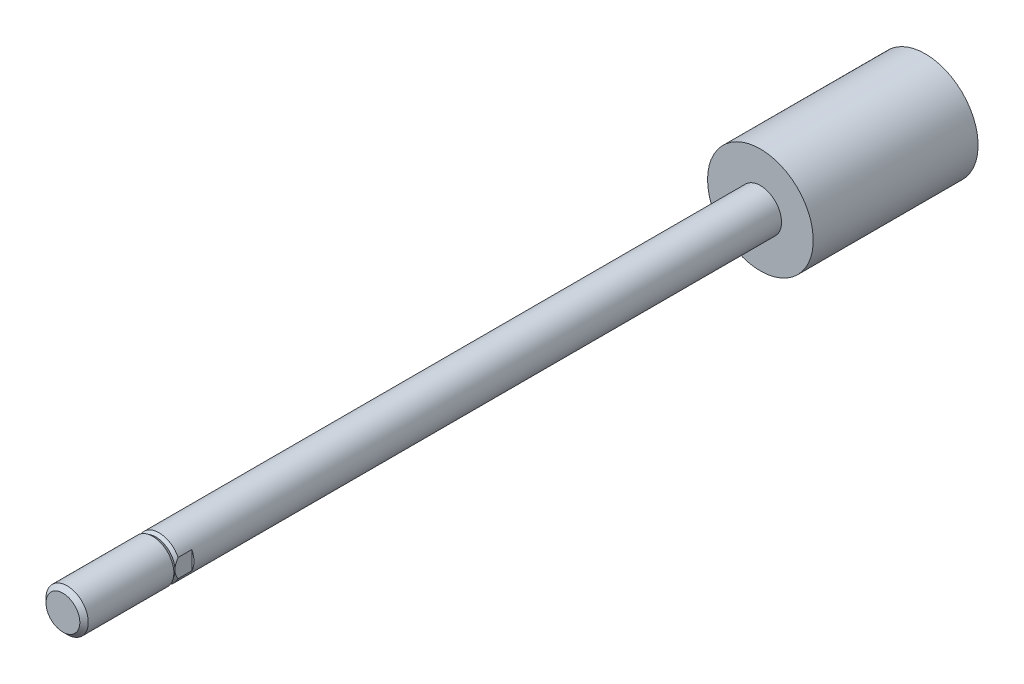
ISO-10303-21;
HEADER;
FILE_DESCRIPTION(('STEP AP214'),'2;1');
FILE_NAME('part.step','',(''),(''),'','','');
FILE_SCHEMA(('AUTOMOTIVE_DESIGN { 1 0 10303 214 1 1 1 1 }'));
ENDSEC;
DATA;
#1=APPLICATION_CONTEXT('core data for automotive mechanical design processes');
#2=APPLICATION_PROTOCOL_DEFINITION('international standard','automotive_design',2000,#1);
#3=PRODUCT_CONTEXT('',#1,'mechanical');
#4=PRODUCT('Part','Part','',(#3));
#5=PRODUCT_RELATED_PRODUCT_CATEGORY('part','',(#4));
#6=PRODUCT_DEFINITION_FORMATION('','',#4);
#7=PRODUCT_DEFINITION_CONTEXT('part definition',#1,'design');
#8=PRODUCT_DEFINITION('design','',#6,#7);
#9=PRODUCT_DEFINITION_SHAPE('','',#8);
#10=(LENGTH_UNIT() NAMED_UNIT(*) SI_UNIT(.MILLI.,.METRE.));
#11=(NAMED_UNIT(*) PLANE_ANGLE_UNIT() SI_UNIT($,.RADIAN.));
#12=(NAMED_UNIT(*) SI_UNIT($,.STERADIAN.) SOLID_ANGLE_UNIT());
#13=UNCERTAINTY_MEASURE_WITH_UNIT(LENGTH_MEASURE(1.E-05),#10,'distance_accuracy_value','');
#14=(GEOMETRIC_REPRESENTATION_CONTEXT(3) GLOBAL_UNCERTAINTY_ASSIGNED_CONTEXT((#13)) GLOBAL_UNIT_ASSIGNED_CONTEXT((#10,
#11,#12)) REPRESENTATION_CONTEXT('',''));
#15=CARTESIAN_POINT('',(0.,0.,0.));
#16=DIRECTION('',(0.,0.,1.));
#17=DIRECTION('',(1.,0.,0.));
#18=AXIS2_PLACEMENT_3D('',#15,#16,#17);
#19=CARTESIAN_POINT('',(12.65,-12.65,0.));
#20=DIRECTION('',(0.,0.,-1.));
#21=DIRECTION('',(-1.,0.,0.));
#22=AXIS2_PLACEMENT_3D('',#19,#20,#21);
#23=PLANE('',#22);
#24=CARTESIAN_POINT('',(0.,0.,0.));
#25=DIRECTION('',(0.,0.,-1.));
#26=DIRECTION('',(-1.,0.,0.));
#27=AXIS2_PLACEMENT_3D('',#24,#25,#26);
#28=CIRCLE('',#27,12.5);
#29=CARTESIAN_POINT('',(-12.5,0.,0.));
#30=VERTEX_POINT('',#29);
#31=EDGE_CURVE('E20',#30,#30,#28,.T.);
#32=ORIENTED_EDGE('',*,*,#31,.T.);
#33=EDGE_LOOP('',(#32));
#34=FACE_BOUND('',#33,.T.);
#35=ADVANCED_FACE('F16',(#34),#23,.T.);
#36=CARTESIAN_POINT('',(0.,0.,39.));
#37=DIRECTION('',(0.,0.,-1.));
#38=DIRECTION('',(-1.,0.,0.));
#39=AXIS2_PLACEMENT_3D('',#36,#37,#38);
#40=CYLINDRICAL_SURFACE('',#39,12.5);
#41=CARTESIAN_POINT('',(0.,0.,39.));
#42=DIRECTION('',(0.,0.,-1.));
#43=DIRECTION('',(-1.,0.,0.));
#44=AXIS2_PLACEMENT_3D('',#41,#42,#43);
#45=CIRCLE('',#44,12.5);
#46=CARTESIAN_POINT('',(-12.5,0.,39.));
#47=VERTEX_POINT('',#46);
#48=EDGE_CURVE('E276',#47,#47,#45,.F.);
#49=ORIENTED_EDGE('',*,*,#48,.F.);
#50=EDGE_LOOP('',(#49));
#51=FACE_BOUND('',#50,.T.);
#52=ORIENTED_EDGE('',*,*,#31,.F.);
#53=EDGE_LOOP('',(#52));
#54=FACE_BOUND('',#53,.T.);
#55=ADVANCED_FACE('F153',(#51,#54),#40,.T.);
#56=CARTESIAN_POINT('',(-5.003,-2.205602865,178.));
#57=DIRECTION('',(0.,0.,1.));
#58=DIRECTION('',(1.,0.,0.));
#59=AXIS2_PLACEMENT_3D('',#56,#57,#58);
#60=PLANE('',#59);
#61=CARTESIAN_POINT('',(0.,0.,178.000000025));
#62=DIRECTION('',(0.,0.,-1.));
#63=DIRECTION('',(0.,1.,0.));
#64=AXIS2_PLACEMENT_3D('',#61,#62,#63);
#65=CIRCLE('',#64,5.);
#66=CARTESIAN_POINT('',(-4.49999999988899,2.17944947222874,178.0000000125));
#67=VERTEX_POINT('',#66);
#68=CARTESIAN_POINT('',(-4.5,-2.17944947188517,178.0000000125));
#69=VERTEX_POINT('',#68);
#70=EDGE_CURVE('E102',#67,#69,#65,.F.);
#71=ORIENTED_EDGE('',*,*,#70,.T.);
#72=DIRECTION('',(0.,1.,0.));
#73=VECTOR('',#72,1.);
#74=CARTESIAN_POINT('',(-4.5,0.,178.));
#75=LINE('',#74,#73);
#76=EDGE_CURVE('E103',#69,#67,#75,.T.);
#77=ORIENTED_EDGE('',*,*,#76,.T.);
#78=EDGE_LOOP('',(#71,#77));
#79=FACE_BOUND('',#78,.T.);
#80=ADVANCED_FACE('F149',(#79),#60,.T.);
#81=CARTESIAN_POINT('',(-12.65,-12.65,39.));
#82=DIRECTION('',(0.,0.,1.));
#83=DIRECTION('',(1.,0.,0.));
#84=AXIS2_PLACEMENT_3D('',#81,#82,#83);
#85=PLANE('',#84);
#86=CARTESIAN_POINT('',(0.,-3.94823063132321E-13,39.));
#87=DIRECTION('',(0.,0.,-1.));
#88=DIRECTION('',(0.,1.,0.));
#89=AXIS2_PLACEMENT_3D('',#86,#87,#88);
#90=CIRCLE('',#89,5.);
#91=CARTESIAN_POINT('',(0.,4.99999999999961,39.));
#92=VERTEX_POINT('',#91);
#93=EDGE_CURVE('E69',#92,#92,#90,.T.);
#94=ORIENTED_EDGE('',*,*,#93,.T.);
#95=EDGE_LOOP('',(#94));
#96=FACE_BOUND('',#95,.T.);
#97=ORIENTED_EDGE('',*,*,#48,.T.);
#98=EDGE_LOOP('',(#97));
#99=FACE_BOUND('',#98,.T.);
#100=ADVANCED_FACE('F146',(#96,#99),#85,.T.);
#101=CARTESIAN_POINT('',(4.5,-2.205602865,178.));
#102=DIRECTION('',(0.,0.,1.));
#103=DIRECTION('',(1.,0.,0.));
#104=AXIS2_PLACEMENT_3D('',#101,#102,#103);
#105=PLANE('',#104);
#106=CARTESIAN_POINT('',(0.,0.,178.000000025));
#107=DIRECTION('',(0.,0.,-1.));
#108=DIRECTION('',(0.,1.,0.));
#109=AXIS2_PLACEMENT_3D('',#106,#107,#108);
#110=CIRCLE('',#109,5.);
#111=CARTESIAN_POINT('',(4.5,-2.17944947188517,178.0000000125));
#112=VERTEX_POINT('',#111);
#113=CARTESIAN_POINT('',(4.5,2.17944947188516,178.0000000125));
#114=VERTEX_POINT('',#113);
#115=EDGE_CURVE('E59',#112,#114,#110,.F.);
#116=ORIENTED_EDGE('',*,*,#115,.T.);
#117=DIRECTION('',(0.,-1.,0.));
#118=VECTOR('',#117,1.);
#119=CARTESIAN_POINT('',(4.5,0.,178.));
#120=LINE('',#119,#118);
#121=EDGE_CURVE('E71',#114,#112,#120,.T.);
#122=ORIENTED_EDGE('',*,*,#121,.T.);
#123=EDGE_LOOP('',(#116,#122));
#124=FACE_BOUND('',#123,.T.);
#125=ADVANCED_FACE('F72',(#124),#105,.T.);
#126=CARTESIAN_POINT('',(-4.5,-2.179449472,182.024));
#127=DIRECTION('',(1.,0.,0.));
#128=DIRECTION('',(0.,0.,-1.));
#129=AXIS2_PLACEMENT_3D('',#126,#127,#128);
#130=PLANE('',#129);
#131=DIRECTION('',(0.,0.,1.));
#132=VECTOR('',#131,1.);
#133=CARTESIAN_POINT('',(-4.49999999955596,2.17944947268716,110.125));
#134=LINE('',#133,#132);
#135=CARTESIAN_POINT('',(-4.49999999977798,2.1794494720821,181.250000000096));
#136=VERTEX_POINT('',#135);
#137=EDGE_CURVE('E100',#136,#67,#134,.F.);
#138=ORIENTED_EDGE('',*,*,#137,.T.);
#139=ORIENTED_EDGE('',*,*,#76,.F.);
#140=DIRECTION('',(0.,0.,-1.));
#141=VECTOR('',#140,1.);
#142=CARTESIAN_POINT('',(-4.5,-2.179449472,180.012));
#143=LINE('',#142,#141);
#144=CARTESIAN_POINT('',(-4.5,-2.17944947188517,181.249999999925));
#145=VERTEX_POINT('',#144);
#146=EDGE_CURVE('E83',#145,#69,#143,.T.);
#147=ORIENTED_EDGE('',*,*,#146,.F.);
#148=CARTESIAN_POINT('',(-4.5,-2.17944947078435,181.250000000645));
#149=CARTESIAN_POINT('',(-4.5,-2.06384936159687,181.325517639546));
#150=CARTESIAN_POINT('',(-4.5,-1.94593594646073,181.397805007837));
#151=CARTESIAN_POINT('',(-4.5,-1.70455072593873,181.533955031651));
#152=CARTESIAN_POINT('',(-4.5,-1.58105289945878,181.597771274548));
#153=CARTESIAN_POINT('',(-4.5,-1.33299920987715,181.712222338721));
#154=CARTESIAN_POINT('',(-4.5,-1.20861697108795,181.763226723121));
#155=CARTESIAN_POINT('',(-4.5,-0.955459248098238,181.851988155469));
#156=CARTESIAN_POINT('',(-4.5,-0.826694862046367,181.889776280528));
#157=CARTESIAN_POINT('',(-4.5,-0.582832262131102,181.945687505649));
#158=CARTESIAN_POINT('',(-4.5,-0.468188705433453,181.965755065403));
#159=CARTESIAN_POINT('',(-4.5,-0.294276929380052,181.986150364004));
#160=CARTESIAN_POINT('',(-4.5,-0.235552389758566,181.991332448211));
#161=CARTESIAN_POINT('',(-4.5,-0.11788968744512,181.998261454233));
#162=CARTESIAN_POINT('',(-4.5,-0.0589514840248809,182.000007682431));
#163=CARTESIAN_POINT('',(-4.5,-2.8851410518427E-10,182.));
#164=B_SPLINE_CURVE_WITH_KNOTS('',3,(#148,#149,#150,#151,#152,#153,#154,#155,#156,#157,#158,
#159,#160,#161,#162,#163),.UNSPECIFIED.,.F.,.F.,(4,2,2,2,2,2,2,4),(0.,0.414444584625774,
0.831073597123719,1.23376409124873,1.63550121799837,1.98391394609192,2.16068182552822,
2.33748538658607),.UNSPECIFIED.);
#165=CARTESIAN_POINT('',(-4.5,-4.32775993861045E-10,182.));
#166=VERTEX_POINT('',#165);
#167=EDGE_CURVE('E90',#145,#166,#164,.T.);
#168=ORIENTED_EDGE('',*,*,#167,.T.);
#169=CARTESIAN_POINT('',(-4.5,-2.88517512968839E-10,182.));
#170=CARTESIAN_POINT('',(-4.5,0.0990392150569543,182.000079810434));
#171=CARTESIAN_POINT('',(-4.5,0.198028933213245,181.995098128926));
#172=CARTESIAN_POINT('',(-4.5,0.394886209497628,181.975637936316));
#173=CARTESIAN_POINT('',(-4.5,0.492755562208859,181.961177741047));
#174=CARTESIAN_POINT('',(-4.5,0.684746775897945,181.923770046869));
#175=CARTESIAN_POINT('',(-4.5,0.778904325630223,181.901002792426));
#176=CARTESIAN_POINT('',(-4.5,0.965068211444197,181.847879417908));
#177=CARTESIAN_POINT('',(-4.5,1.05707375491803,181.817520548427));
#178=CARTESIAN_POINT('',(-4.5,1.23784288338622,181.750503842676));
#179=CARTESIAN_POINT('',(-4.5,1.32662746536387,181.713902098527));
#180=CARTESIAN_POINT('',(-4.5,1.50171378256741,181.635164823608));
#181=CARTESIAN_POINT('',(-4.5,1.588014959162,181.59302805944));
#182=CARTESIAN_POINT('',(-4.5,1.7599990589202,181.503129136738));
#183=CARTESIAN_POINT('',(-4.5,1.84562826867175,181.455265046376));
#184=CARTESIAN_POINT('',(-4.5,2.01436529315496,181.355487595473));
#185=CARTESIAN_POINT('',(-4.5,2.09747595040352,181.3035790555));
#186=CARTESIAN_POINT('',(-4.5,2.17944947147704,181.250000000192));
#187=B_SPLINE_CURVE_WITH_KNOTS('',3,(#169,#170,#171,#172,#173,#174,#175,#176,#177,#178,#179,
#180,#181,#182,#183,#184,#185,#186),.UNSPECIFIED.,.F.,.F.,(4,2,2,2,2,2,2,2,4),(0.,
0.296913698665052,0.593255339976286,0.88351617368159,1.1738822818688,1.46176505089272,
1.74971207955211,2.04388501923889,2.3377125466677),.UNSPECIFIED.);
#188=EDGE_CURVE('E77',#166,#136,#187,.T.);
#189=ORIENTED_EDGE('',*,*,#188,.T.);
#190=EDGE_LOOP('',(#138,#139,#147,#168,#189));
#191=FACE_BOUND('',#190,.T.);
#192=ADVANCED_FACE('F138',(#191),#130,.F.);
#193=CARTESIAN_POINT('',(0.,0.,181.25));
#194=DIRECTION('',(0.,0.,-1.));
#195=DIRECTION('',(0.,1.,0.));
#196=AXIS2_PLACEMENT_3D('',#193,#194,#195);
#197=CYLINDRICAL_SURFACE('',#196,5.);
#198=ORIENTED_EDGE('',*,*,#93,.F.);
#199=EDGE_LOOP('',(#198));
#200=FACE_BOUND('',#199,.T.);
#201=ORIENTED_EDGE('',*,*,#115,.F.);
#202=DIRECTION('',(0.,0.,1.));
#203=VECTOR('',#202,1.);
#204=CARTESIAN_POINT('',(4.5,-2.179449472,180.012));
#205=LINE('',#204,#203);
#206=CARTESIAN_POINT('',(4.5,-2.17944947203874,181.2499999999));
#207=VERTEX_POINT('',#206);
#208=EDGE_CURVE('E64',#112,#207,#205,.T.);
#209=ORIENTED_EDGE('',*,*,#208,.T.);
#210=CARTESIAN_POINT('',(0.,0.,181.25));
#211=DIRECTION('',(0.,0.,-1.));
#212=DIRECTION('',(0.,1.,0.));
#213=AXIS2_PLACEMENT_3D('',#210,#211,#212);
#214=CIRCLE('',#213,5.);
#215=EDGE_CURVE('E98',#207,#145,#214,.T.);
#216=ORIENTED_EDGE('',*,*,#215,.T.);
#217=ORIENTED_EDGE('',*,*,#146,.T.);
#218=ORIENTED_EDGE('',*,*,#70,.F.);
#219=ORIENTED_EDGE('',*,*,#137,.F.);
#220=CARTESIAN_POINT('',(0.,0.,181.25));
#221=DIRECTION('',(0.,0.,-1.));
#222=DIRECTION('',(0.,1.,0.));
#223=AXIS2_PLACEMENT_3D('',#220,#221,#222);
#224=CIRCLE('',#223,5.);
#225=CARTESIAN_POINT('',(4.5,2.17944947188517,181.249999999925));
#226=VERTEX_POINT('',#225);
#227=EDGE_CURVE('E88',#136,#226,#224,.T.);
#228=ORIENTED_EDGE('',*,*,#227,.T.);
#229=DIRECTION('',(0.,0.,-1.));
#230=VECTOR('',#229,1.);
#231=CARTESIAN_POINT('',(4.5,2.179449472,180.012));
#232=LINE('',#231,#230);
#233=EDGE_CURVE('E66',#226,#114,#232,.T.);
#234=ORIENTED_EDGE('',*,*,#233,.T.);
#235=EDGE_LOOP('',(#201,#209,#216,#217,#218,#219,#228,#234));
#236=FACE_BOUND('',#235,.T.);
#237=ADVANCED_FACE('F61',(#200,#236),#197,.T.);
#238=CARTESIAN_POINT('',(4.5,-2.179449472,178.));
#239=DIRECTION('',(-1.,0.,0.));
#240=DIRECTION('',(0.,0.,1.));
#241=AXIS2_PLACEMENT_3D('',#238,#239,#240);
#242=PLANE('',#241);
#243=ORIENTED_EDGE('',*,*,#208,.F.);
#244=ORIENTED_EDGE('',*,*,#121,.F.);
#245=ORIENTED_EDGE('',*,*,#233,.F.);
#246=CARTESIAN_POINT('',(4.5,2.17944947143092,181.250000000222));
#247=CARTESIAN_POINT('',(4.5,2.06384936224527,181.32551763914));
#248=CARTESIAN_POINT('',(4.5,1.94593594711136,181.397805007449));
#249=CARTESIAN_POINT('',(4.5,1.70455072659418,181.533955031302));
#250=CARTESIAN_POINT('',(4.5,1.58105290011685,181.597771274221));
#251=CARTESIAN_POINT('',(4.5,1.33299921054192,181.712222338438));
#252=CARTESIAN_POINT('',(4.5,1.20861697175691,181.763226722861));
#253=CARTESIAN_POINT('',(4.5,0.955459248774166,181.851988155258));
#254=CARTESIAN_POINT('',(4.5,0.826694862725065,181.889776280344));
#255=CARTESIAN_POINT('',(4.5,0.582832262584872,181.94568750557));
#256=CARTESIAN_POINT('',(4.5,0.468188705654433,181.965755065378));
#257=CARTESIAN_POINT('',(4.5,0.294276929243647,181.98615036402));
#258=CARTESIAN_POINT('',(4.5,0.235552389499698,181.991332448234));
#259=CARTESIAN_POINT('',(4.5,0.117889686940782,181.998261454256));
#260=CARTESIAN_POINT('',(4.5,0.0589514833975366,182.000007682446));
#261=CARTESIAN_POINT('',(4.5,-4.61487654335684E-10,182.));
#262=B_SPLINE_CURVE_WITH_KNOTS('',3,(#246,#247,#248,#249,#250,#251,#252,#253,#254,#255,#256,
#257,#258,#259,#260,#261),.UNSPECIFIED.,.F.,.F.,(4,2,2,2,2,2,2,4),(0.,0.414444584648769,
0.831073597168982,1.23376409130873,1.6355012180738,1.98391394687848,2.16068182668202,
2.33748538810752),.UNSPECIFIED.);
#263=CARTESIAN_POINT('',(4.5,-4.61482135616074E-10,182.));
#264=VERTEX_POINT('',#263);
#265=EDGE_CURVE('E35',#226,#264,#262,.T.);
#266=ORIENTED_EDGE('',*,*,#265,.T.);
#267=CARTESIAN_POINT('',(4.5,-4.61481856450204E-10,182.));
#268=CARTESIAN_POINT('',(4.5,-0.0990392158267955,182.00007981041));
#269=CARTESIAN_POINT('',(4.5,-0.198028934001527,181.995098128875));
#270=CARTESIAN_POINT('',(4.5,-0.394886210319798,181.975637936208));
#271=CARTESIAN_POINT('',(4.5,-0.492755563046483,181.961177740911));
#272=CARTESIAN_POINT('',(4.5,-0.684746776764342,181.923770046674));
#273=CARTESIAN_POINT('',(4.5,-0.778904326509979,181.901002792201));
#274=CARTESIAN_POINT('',(4.5,-0.965068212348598,181.847879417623));
#275=CARTESIAN_POINT('',(4.5,-1.05707375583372,181.817520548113));
#276=CARTESIAN_POINT('',(4.5,-1.23784288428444,181.750503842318));
#277=CARTESIAN_POINT('',(4.5,-1.32662746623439,181.713902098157));
#278=CARTESIAN_POINT('',(4.5,-1.50171378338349,181.63516482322));
#279=CARTESIAN_POINT('',(4.5,-1.58801495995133,181.593028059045));
#280=CARTESIAN_POINT('',(4.5,-1.75999905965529,181.503129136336));
#281=CARTESIAN_POINT('',(4.5,-1.8456282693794,181.455265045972));
#282=CARTESIAN_POINT('',(4.5,-2.01436529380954,181.355487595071));
#283=CARTESIAN_POINT('',(4.5,-2.09747595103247,181.3035790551));
#284=CARTESIAN_POINT('',(4.5,-2.17944947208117,181.249999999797));
#285=B_SPLINE_CURVE_WITH_KNOTS('',3,(#267,#268,#269,#270,#271,#272,#273,#274,#275,#276,#277,
#278,#279,#280,#281,#282,#283,#284),.UNSPECIFIED.,.F.,.F.,(4,2,2,2,2,2,2,2,4),(0.,
0.296913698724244,0.593255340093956,0.883516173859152,1.17388228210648,1.46176505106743,
1.74971207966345,2.04388501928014,2.33771254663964),.UNSPECIFIED.);
#286=EDGE_CURVE('E75',#264,#207,#285,.T.);
#287=ORIENTED_EDGE('',*,*,#286,.T.);
#288=EDGE_LOOP('',(#243,#244,#245,#266,#287));
#289=FACE_BOUND('',#288,.T.);
#290=ADVANCED_FACE('F74',(#289),#242,.F.);
#291=CARTESIAN_POINT('',(0.,0.,182.));
#292=DIRECTION('',(0.,0.,-1.));
#293=DIRECTION('',(-1.,0.,0.));
#294=AXIS2_PLACEMENT_3D('',#291,#292,#293);
#295=CONICAL_SURFACE('',#294,4.5,0.588002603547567);
#296=ORIENTED_EDGE('',*,*,#215,.F.);
#297=ORIENTED_EDGE('',*,*,#286,.F.);
#298=CARTESIAN_POINT('',(0.,0.,182.));
#299=DIRECTION('',(0.,0.,1.));
#300=DIRECTION('',(0.,-1.,0.));
#301=AXIS2_PLACEMENT_3D('',#298,#299,#300);
#302=CIRCLE('',#301,4.5);
#303=EDGE_CURVE('E96',#264,#166,#302,.F.);
#304=ORIENTED_EDGE('',*,*,#303,.T.);
#305=ORIENTED_EDGE('',*,*,#167,.F.);
#306=EDGE_LOOP('',(#296,#297,#304,#305));
#307=FACE_BOUND('',#306,.T.);
#308=ADVANCED_FACE('F124',(#307),#295,.T.);
#309=CARTESIAN_POINT('',(0.,0.,182.));
#310=DIRECTION('',(0.,0.,-1.));
#311=DIRECTION('',(-1.,0.,0.));
#312=AXIS2_PLACEMENT_3D('',#309,#310,#311);
#313=CONICAL_SURFACE('',#312,4.5,0.588002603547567);
#314=CARTESIAN_POINT('',(0.,0.,182.));
#315=DIRECTION('',(0.,0.,1.));
#316=DIRECTION('',(0.,-1.,0.));
#317=AXIS2_PLACEMENT_3D('',#314,#315,#316);
#318=CIRCLE('',#317,4.5);
#319=EDGE_CURVE('E93',#166,#264,#318,.F.);
#320=ORIENTED_EDGE('',*,*,#319,.T.);
#321=ORIENTED_EDGE('',*,*,#265,.F.);
#322=ORIENTED_EDGE('',*,*,#227,.F.);
#323=ORIENTED_EDGE('',*,*,#188,.F.);
#324=EDGE_LOOP('',(#320,#321,#322,#323));
#325=FACE_BOUND('',#324,.T.);
#326=ADVANCED_FACE('F120',(#325),#313,.T.);
#327=CARTESIAN_POINT('',(-4.048,-4.048,204.));
#328=DIRECTION('',(0.,0.,1.));
#329=DIRECTION('',(1.,0.,0.));
#330=AXIS2_PLACEMENT_3D('',#327,#328,#329);
#331=PLANE('',#330);
#332=CARTESIAN_POINT('',(0.,0.,204.));
#333=DIRECTION('',(0.,0.,-1.));
#334=DIRECTION('',(-1.,0.,0.));
#335=AXIS2_PLACEMENT_3D('',#332,#333,#334);
#336=CIRCLE('',#335,4.00000000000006);
#337=CARTESIAN_POINT('',(-4.00000000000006,0.,204.));
#338=VERTEX_POINT('',#337);
#339=EDGE_CURVE('E86',#338,#338,#336,.F.);
#340=ORIENTED_EDGE('',*,*,#339,.T.);
#341=EDGE_LOOP('',(#340));
#342=FACE_BOUND('',#341,.T.);
#343=ADVANCED_FACE('F18',(#342),#331,.T.);
#344=CARTESIAN_POINT('',(0.,0.,182.));
#345=DIRECTION('',(0.,0.,1.));
#346=DIRECTION('',(1.,0.,0.));
#347=AXIS2_PLACEMENT_3D('',#344,#345,#346);
#348=CONICAL_SURFACE('',#347,4.5,0.588002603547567);
#349=CARTESIAN_POINT('',(0.,0.,182.75));
#350=DIRECTION('',(0.,0.,-1.));
#351=DIRECTION('',(-1.,0.,0.));
#352=AXIS2_PLACEMENT_3D('',#349,#350,#351);
#353=CIRCLE('',#352,5.);
#354=CARTESIAN_POINT('',(-5.,0.,182.75));
#355=VERTEX_POINT('',#354);
#356=EDGE_CURVE('E26',#355,#355,#353,.T.);
#357=ORIENTED_EDGE('',*,*,#356,.T.);
#358=EDGE_LOOP('',(#357));
#359=FACE_BOUND('',#358,.T.);
#360=ORIENTED_EDGE('',*,*,#319,.F.);
#361=ORIENTED_EDGE('',*,*,#303,.F.);
#362=EDGE_LOOP('',(#360,#361));
#363=FACE_BOUND('',#362,.T.);
#364=ADVANCED_FACE('F128',(#359,#363),#348,.T.);
#365=CARTESIAN_POINT('',(0.,0.,204.));
#366=DIRECTION('',(0.,0.,-1.));
#367=DIRECTION('',(-1.,0.,0.));
#368=AXIS2_PLACEMENT_3D('',#365,#366,#367);
#369=CONICAL_SURFACE('',#368,4.,0.785398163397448);
#370=ORIENTED_EDGE('',*,*,#339,.F.);
#371=EDGE_LOOP('',(#370));
#372=FACE_BOUND('',#371,.T.);
#373=CARTESIAN_POINT('',(0.,0.,203.));
#374=DIRECTION('',(0.,0.,-1.));
#375=DIRECTION('',(-1.,0.,0.));
#376=AXIS2_PLACEMENT_3D('',#373,#374,#375);
#377=CIRCLE('',#376,5.);
#378=CARTESIAN_POINT('',(-5.,0.,203.));
#379=VERTEX_POINT('',#378);
#380=EDGE_CURVE('E11',#379,#379,#377,.F.);
#381=ORIENTED_EDGE('',*,*,#380,.T.);
#382=EDGE_LOOP('',(#381));
#383=FACE_BOUND('',#382,.T.);
#384=ADVANCED_FACE('F160',(#372,#383),#369,.T.);
#385=CARTESIAN_POINT('',(0.,0.,203.));
#386=DIRECTION('',(0.,0.,-1.));
#387=DIRECTION('',(-1.,0.,0.));
#388=AXIS2_PLACEMENT_3D('',#385,#386,#387);
#389=CYLINDRICAL_SURFACE('',#388,5.);
#390=ORIENTED_EDGE('',*,*,#356,.F.);
#391=EDGE_LOOP('',(#390));
#392=FACE_BOUND('',#391,.T.);
#393=ORIENTED_EDGE('',*,*,#380,.F.);
#394=EDGE_LOOP('',(#393));
#395=FACE_BOUND('',#394,.T.);
#396=ADVANCED_FACE('F158',(#392,#395),#389,.T.);
#397=CLOSED_SHELL('',(#35,#55,#80,#100,#125,#192,#237,#290,#308,#326,#343,#364,#384,#396));
#398=MANIFOLD_SOLID_BREP('B1',#397);
#399=ADVANCED_BREP_SHAPE_REPRESENTATION('',(#18,#398),#14);
#400=SHAPE_DEFINITION_REPRESENTATION(#9,#399);
ENDSEC;
END-ISO-10303-21;
